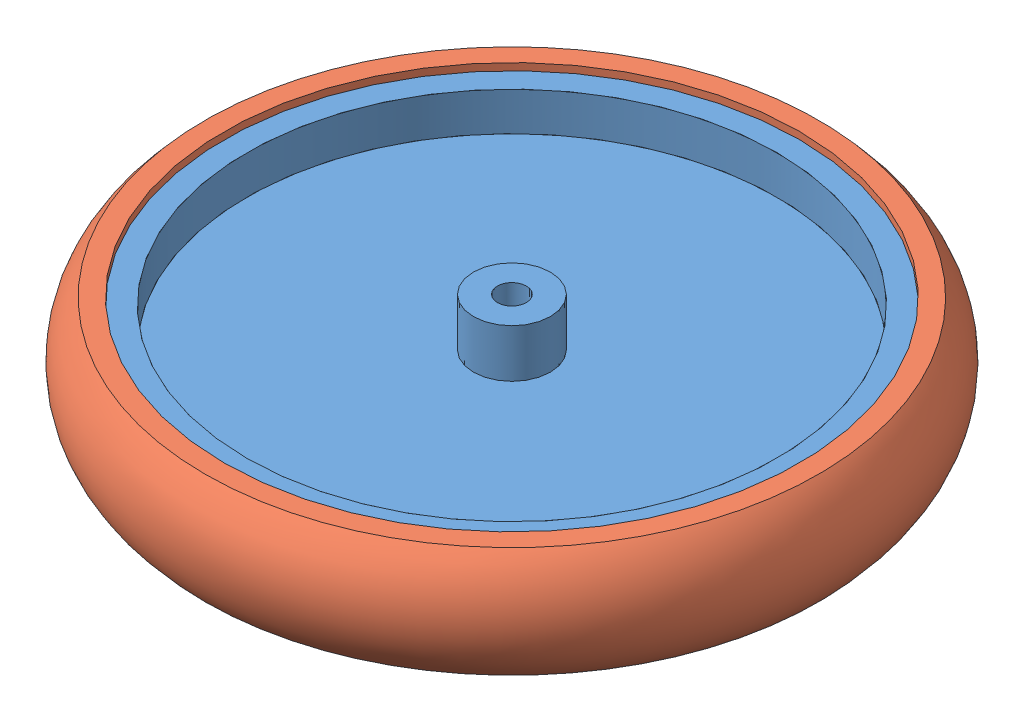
SolidWorks assembly Roue complète.SLDASM, configuration Défaut (file format 8000). Lengths in mm.
Overall size (68.42 11.74 68.42).
2 component instances, 2 part files, 2 mates.
Components (placement in the parent):
- roue-1: roue.SLDPRT [Default] at (-54.361 -13.6369 0) size (62.55 11 62.54)
- pneu-1: pneu.SLDPRT [Défaut] at (-86.1957 -14.3752 0) x (0 1 0) z (0 0 1) size (11.48 68.42 68.42)
Mates (geometry in assembly coordinates):
- Coaxiale1: concentric anti-aligned: circle of roue-1; circle of pneu-1
- Coïncidente1: coincident anti-aligned: plane of roue-1 through (-54.361 -13.6369 0) normal (0 -1 0); plane of pneu-1 through (-84.1957 -13.6369 0) normal (0 1 0)
